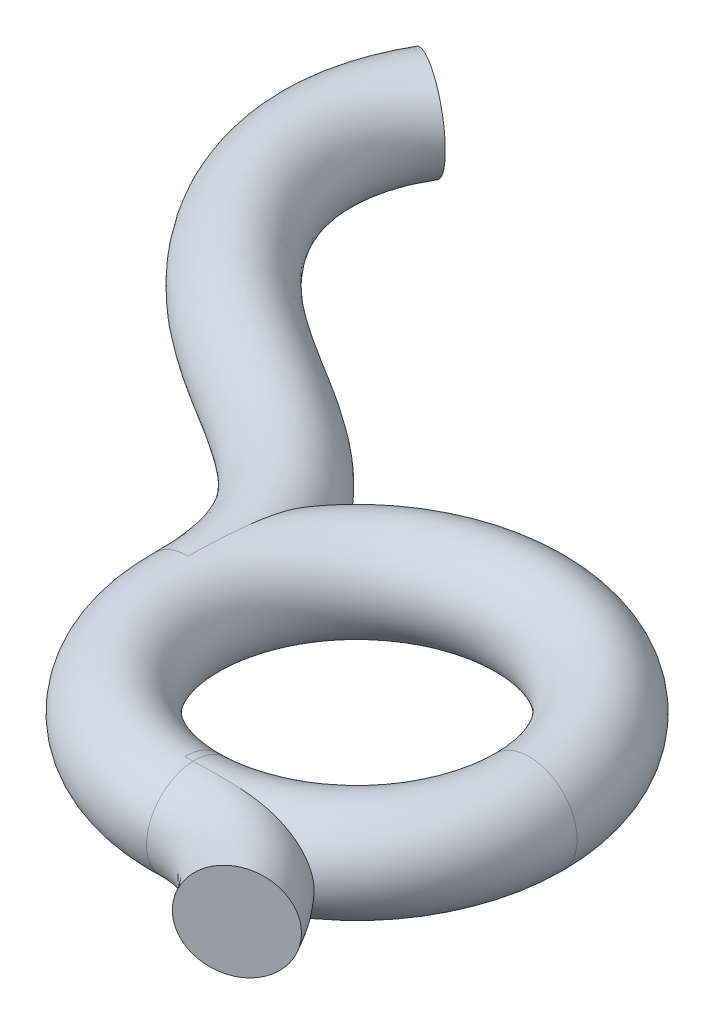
ISO-10303-21;
HEADER;
FILE_DESCRIPTION(('STEP AP214'),'2;1');
FILE_NAME('part.step','',(''),(''),'','','');
FILE_SCHEMA(('AUTOMOTIVE_DESIGN { 1 0 10303 214 1 1 1 1 }'));
ENDSEC;
DATA;
#1=APPLICATION_CONTEXT('core data for automotive mechanical design processes');
#2=APPLICATION_PROTOCOL_DEFINITION('international standard','automotive_design',2000,#1);
#3=PRODUCT_CONTEXT('',#1,'mechanical');
#4=PRODUCT('Part','Part','',(#3));
#5=PRODUCT_RELATED_PRODUCT_CATEGORY('part','',(#4));
#6=PRODUCT_DEFINITION_FORMATION('','',#4);
#7=PRODUCT_DEFINITION_CONTEXT('part definition',#1,'design');
#8=PRODUCT_DEFINITION('design','',#6,#7);
#9=PRODUCT_DEFINITION_SHAPE('','',#8);
#10=(LENGTH_UNIT() NAMED_UNIT(*) SI_UNIT(.MILLI.,.METRE.));
#11=(NAMED_UNIT(*) PLANE_ANGLE_UNIT() SI_UNIT($,.RADIAN.));
#12=(NAMED_UNIT(*) SI_UNIT($,.STERADIAN.) SOLID_ANGLE_UNIT());
#13=UNCERTAINTY_MEASURE_WITH_UNIT(LENGTH_MEASURE(1.E-05),#10,'distance_accuracy_value','');
#14=(GEOMETRIC_REPRESENTATION_CONTEXT(3) GLOBAL_UNCERTAINTY_ASSIGNED_CONTEXT((#13)) GLOBAL_UNIT_ASSIGNED_CONTEXT((#10,
#11,#12)) REPRESENTATION_CONTEXT('',''));
#15=CARTESIAN_POINT('',(0.,0.,0.));
#16=DIRECTION('',(0.,0.,1.));
#17=DIRECTION('',(1.,0.,0.));
#18=AXIS2_PLACEMENT_3D('',#15,#16,#17);
#19=CARTESIAN_POINT('',(0.,0.,0.));
#20=DIRECTION('',(0.,1.,0.));
#21=DIRECTION('',(0.,0.,1.));
#22=AXIS2_PLACEMENT_3D('',#19,#20,#21);
#23=TOROIDAL_SURFACE('',#22,4.57199999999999,1.27);
#24=CARTESIAN_POINT('',(-4.57125664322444,1.27,-0.0824421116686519));
#25=CARTESIAN_POINT('',(-4.57102640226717,1.26999974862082,-0.102875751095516));
#26=CARTESIAN_POINT('',(-4.57076214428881,1.26999984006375,-0.123309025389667));
#27=CARTESIAN_POINT('',(-4.56934847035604,1.26999961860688,-0.220367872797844));
#28=CARTESIAN_POINT('',(-4.56776340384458,1.26999750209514,-0.296987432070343));
#29=CARTESIAN_POINT('',(-4.56323711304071,1.26993153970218,-0.468747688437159));
#30=CARTESIAN_POINT('',(-4.56006048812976,1.26985287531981,-0.563882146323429));
#31=CARTESIAN_POINT('',(-4.55336028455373,1.26941110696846,-0.732918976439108));
#32=CARTESIAN_POINT('',(-4.55007155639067,1.26911525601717,-0.806831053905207));
#33=CARTESIAN_POINT('',(-4.53924451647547,1.26765845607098,-1.02849538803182));
#34=CARTESIAN_POINT('',(-4.53074464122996,1.26592834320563,-1.17619825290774));
#35=CARTESIAN_POINT('',(-4.51178468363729,1.25878900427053,-1.4715849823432));
#36=CARTESIAN_POINT('',(-4.50132239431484,1.25337561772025,-1.6192686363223));
#37=CARTESIAN_POINT('',(-4.48326316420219,1.23898936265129,-1.85813739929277));
#38=CARTESIAN_POINT('',(-4.47608723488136,1.23214941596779,-1.94947641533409));
#39=CARTESIAN_POINT('',(-4.46133628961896,1.21480273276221,-2.13180974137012));
#40=CARTESIAN_POINT('',(-4.45376118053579,1.20429513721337,-2.22280396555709));
#41=CARTESIAN_POINT('',(-4.43835601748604,1.1784670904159,-2.40394155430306));
#42=CARTESIAN_POINT('',(-4.43052644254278,1.16315526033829,-2.49408614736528));
#43=CARTESIAN_POINT('',(-4.41474172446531,1.12632993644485,-2.67306396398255));
#44=CARTESIAN_POINT('',(-4.40678666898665,1.10482060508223,-2.76189802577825));
#45=CARTESIAN_POINT('',(-4.39060428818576,1.05296860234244,-2.94071382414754));
#46=CARTESIAN_POINT('',(-4.38237821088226,1.02231902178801,-3.03060909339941));
#47=CARTESIAN_POINT('',(-4.36620890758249,0.950327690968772,-3.20618002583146));
#48=CARTESIAN_POINT('',(-4.35826558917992,0.908989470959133,-3.29185707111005));
#49=CARTESIAN_POINT('',(-4.34465621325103,0.823596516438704,-3.43794592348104));
#50=CARTESIAN_POINT('',(-4.33886983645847,0.782074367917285,-3.49980784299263));
#51=CARTESIAN_POINT('',(-4.32792814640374,0.689890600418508,-3.61640692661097));
#52=CARTESIAN_POINT('',(-4.32277157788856,0.639247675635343,-3.67115827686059));
#53=CARTESIAN_POINT('',(-4.31480272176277,0.544484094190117,-3.75554770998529));
#54=CARTESIAN_POINT('',(-4.31174540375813,0.502771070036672,-3.78785229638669));
#55=CARTESIAN_POINT('',(-4.30628357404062,0.414679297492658,-3.8454748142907));
#56=CARTESIAN_POINT('',(-4.30387873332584,0.368302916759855,-3.87079626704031));
#57=CARTESIAN_POINT('',(-4.29987447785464,0.271166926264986,-3.91291435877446));
#58=CARTESIAN_POINT('',(-4.29828346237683,0.220367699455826,-3.92962211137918));
#59=CARTESIAN_POINT('',(-4.29609800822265,0.116436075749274,-3.95256305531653));
#60=CARTESIAN_POINT('',(-4.29550243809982,0.0633063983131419,-3.95880813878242));
#61=CARTESIAN_POINT('',(-4.2953783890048,-0.0351307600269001,-3.96010902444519));
#62=CARTESIAN_POINT('',(-4.2957041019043,-0.0804239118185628,-3.95669373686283));
#63=CARTESIAN_POINT('',(-4.29709265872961,-0.16972503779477,-3.94212315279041));
#64=CARTESIAN_POINT('',(-4.2981555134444,-0.213732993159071,-3.93096774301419));
#65=CARTESIAN_POINT('',(-4.30090590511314,-0.29824962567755,-3.90206731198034));
#66=CARTESIAN_POINT('',(-4.3025772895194,-0.338818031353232,-3.88449264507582));
#67=CARTESIAN_POINT('',(-4.3064522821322,-0.417030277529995,-3.84368881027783));
#68=CARTESIAN_POINT('',(-4.30865691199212,-0.454668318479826,-3.82044878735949));
#69=CARTESIAN_POINT('',(-4.31472107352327,-0.544808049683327,-3.75641610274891));
#70=CARTESIAN_POINT('',(-4.31885383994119,-0.595206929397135,-3.71268878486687));
#71=CARTESIAN_POINT('',(-4.32779584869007,-0.688376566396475,-3.61779186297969));
#72=CARTESIAN_POINT('',(-4.33260669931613,-0.73112862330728,-3.5666045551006));
#73=CARTESIAN_POINT('',(-4.34155183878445,-0.80078855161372,-3.47111443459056));
#74=CARTESIAN_POINT('',(-4.34559889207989,-0.829106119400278,-3.42780960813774));
#75=CARTESIAN_POINT('',(-4.35387883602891,-0.881790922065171,-3.33896025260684));
#76=CARTESIAN_POINT('',(-4.35811150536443,-0.906162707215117,-3.29341838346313));
#77=CARTESIAN_POINT('',(-4.36671626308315,-0.951437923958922,-3.20055093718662));
#78=CARTESIAN_POINT('',(-4.37108863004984,-0.972333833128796,-3.15322175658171));
#79=CARTESIAN_POINT('',(-4.37991646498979,-1.01098807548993,-3.05730595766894));
#80=CARTESIAN_POINT('',(-4.38437195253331,-1.02874565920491,-3.00871904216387));
#81=CARTESIAN_POINT('',(-4.39496664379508,-1.06750624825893,-2.89259894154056));
#82=CARTESIAN_POINT('',(-4.40112278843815,-1.08730315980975,-2.82466584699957));
#83=CARTESIAN_POINT('',(-4.4134209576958,-1.12255421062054,-2.68766899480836));
#84=CARTESIAN_POINT('',(-4.41956297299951,-1.13800602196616,-2.61860465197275));
#85=CARTESIAN_POINT('',(-4.43787701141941,-1.17901370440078,-2.41011990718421));
#86=CARTESIAN_POINT('',(-4.44991650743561,-1.19915363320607,-2.26963017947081));
#87=CARTESIAN_POINT('',(-4.4731897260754,-1.22992684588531,-1.9870371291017));
#88=CARTESIAN_POINT('',(-4.48441950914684,-1.2405162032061,-1.84492936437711));
#89=CARTESIAN_POINT('',(-4.50552054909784,-1.25575136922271,-1.56045339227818));
#90=CARTESIAN_POINT('',(-4.51539302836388,-1.26040255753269,-1.41808553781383));
#91=CARTESIAN_POINT('',(-4.53021560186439,-1.26547501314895,-1.18174303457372));
#92=CARTESIAN_POINT('',(-4.53569647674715,-1.26679770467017,-1.08781481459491));
#93=CARTESIAN_POINT('',(-4.54567431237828,-1.26862620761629,-0.900085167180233));
#94=CARTESIAN_POINT('',(-4.5501732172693,-1.26913364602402,-0.806283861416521));
#95=CARTESIAN_POINT('',(-4.55624491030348,-1.26961576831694,-0.661547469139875));
#96=CARTESIAN_POINT('',(-4.55821489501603,-1.26972796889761,-0.61062897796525));
#97=CARTESIAN_POINT('',(-4.56180020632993,-1.26988297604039,-0.508759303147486));
#98=CARTESIAN_POINT('',(-4.56341539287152,-1.2699257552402,-0.457808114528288));
#99=CARTESIAN_POINT('',(-4.56729455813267,-1.26999965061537,-0.319161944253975));
#100=CARTESIAN_POINT('',(-4.56918691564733,-1.27000012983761,-0.231455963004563));
#101=CARTESIAN_POINT('',(-4.57076215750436,-1.26999971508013,-0.12330900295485));
#102=CARTESIAN_POINT('',(-4.5710264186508,-1.26999959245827,-0.102875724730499));
#103=CARTESIAN_POINT('',(-4.57125664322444,-1.27,-0.0824421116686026));
#104=B_SPLINE_CURVE_WITH_KNOTS('',3,(#24,#25,#26,#27,#28,#29,#30,#31,#32,#33,#34,#35,#36,#37,
#38,#39,#40,#41,#42,#43,#44,#45,#46,#47,#48,#49,#50,#51,#52,#53,#54,#55,#56,#57,#58,#59,#60,#61,
#62,#63,#64,#65,#66,#67,#68,#69,#70,#71,#72,#73,#74,#75,#76,#77,#78,#79,#80,#81,#82,#83,#84,#85,
#86,#87,#88,#89,#90,#91,#92,#93,#94,#95,#96,#97,#98,#99,#100,#101,#102,#103),.UNSPECIFIED.,.F.,
.F.,(4,2,2,2,2,2,2,2,2,2,2,2,2,2,2,2,2,2,2,2,2,2,2,2,2,2,2,2,2,2,2,2,2,2,2,2,2,2,2,4),(0.,
0.0613048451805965,0.291206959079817,0.576760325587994,0.798714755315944,1.2425560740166,
1.68689957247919,1.96247213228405,2.23810927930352,2.51325459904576,2.78821555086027,
3.07371302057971,3.35911631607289,3.58263509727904,3.80570085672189,3.96368837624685,
4.12159608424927,4.2811022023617,4.44042689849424,4.57600616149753,4.71158740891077,
4.84380489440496,4.97627773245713,5.17570831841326,5.37562013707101,5.53110577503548,
5.68641080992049,5.84204769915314,5.99772170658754,6.2106140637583,6.42362026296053,
6.85032930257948,7.27899106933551,7.70726421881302,7.98955045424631,8.27127263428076,
8.4241417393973,8.5770710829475,8.84024065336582,8.90154549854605),.UNSPECIFIED.);
#105=CARTESIAN_POINT('',(-4.57125664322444,-1.27,-0.0824421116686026));
#106=VERTEX_POINT('',#105);
#107=CARTESIAN_POINT('',(-4.57125664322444,1.27,-0.0824421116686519));
#108=VERTEX_POINT('',#107);
#109=EDGE_CURVE('E101',#106,#108,#104,.F.);
#110=ORIENTED_EDGE('',*,*,#109,.T.);
#111=CARTESIAN_POINT('',(-4.57125664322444,1.27,-0.0824421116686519));
#112=CARTESIAN_POINT('',(-4.59168589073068,1.27000405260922,-0.0826877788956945));
#113=CARTESIAN_POINT('',(-4.61212888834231,1.26950937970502,-0.0829331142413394));
#114=CARTESIAN_POINT('',(-4.70376083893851,1.26506943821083,-0.0840306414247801));
#115=CARTESIAN_POINT('',(-4.77478371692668,1.25560357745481,-0.0848755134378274));
#116=CARTESIAN_POINT('',(-4.8793203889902,1.23258760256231,-0.0861113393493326));
#117=CARTESIAN_POINT('',(-4.91387783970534,1.22342791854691,-0.0865185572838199));
#118=CARTESIAN_POINT('',(-4.9821326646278,1.20222283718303,-0.0873204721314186));
#119=CARTESIAN_POINT('',(-5.01582929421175,1.19017502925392,-0.0877151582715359));
#120=CARTESIAN_POINT('',(-5.11509273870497,1.14986909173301,-0.0888745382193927));
#121=CARTESIAN_POINT('',(-5.17900455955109,1.11741049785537,-0.0896165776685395));
#122=CARTESIAN_POINT('',(-5.30046557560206,1.04220965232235,-0.0910200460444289));
#123=CARTESIAN_POINT('',(-5.35801457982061,0.999467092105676,-0.0916814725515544));
#124=CARTESIAN_POINT('',(-5.43831788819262,0.928604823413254,-0.0926007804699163));
#125=CARTESIAN_POINT('',(-5.46409704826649,0.903841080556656,-0.0928952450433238));
#126=CARTESIAN_POINT('',(-5.51345579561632,0.852257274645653,-0.0934580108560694));
#127=CARTESIAN_POINT('',(-5.53703747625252,0.825439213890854,-0.0937263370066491));
#128=CARTESIAN_POINT('',(-5.60427923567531,0.7421184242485,-0.0944902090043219));
#129=CARTESIAN_POINT('',(-5.64445293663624,0.682734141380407,-0.0949448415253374));
#130=CARTESIAN_POINT('',(-5.71423609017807,0.558096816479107,-0.0957328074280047));
#131=CARTESIAN_POINT('',(-5.74384613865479,0.4928441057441,-0.0960661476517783));
#132=CARTESIAN_POINT('',(-5.79169709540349,0.358286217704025,-0.0966041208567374));
#133=CARTESIAN_POINT('',(-5.80993815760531,0.288981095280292,-0.0968087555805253));
#134=CARTESIAN_POINT('',(-5.83452486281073,0.148294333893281,-0.097084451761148));
#135=CARTESIAN_POINT('',(-5.84087057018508,0.076912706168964,-0.0971555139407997));
#136=CARTESIAN_POINT('',(-5.84148959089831,-0.0659028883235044,-0.0971624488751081));
#137=CARTESIAN_POINT('',(-5.83576290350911,-0.137336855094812,-0.0970983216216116));
#138=CARTESIAN_POINT('',(-5.81239689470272,-0.27823022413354,-0.0968363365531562));
#139=CARTESIAN_POINT('',(-5.79475772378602,-0.347689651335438,-0.0966384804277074));
#140=CARTESIAN_POINT('',(-5.74807619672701,-0.482655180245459,-0.0961137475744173));
#141=CARTESIAN_POINT('',(-5.71903366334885,-0.548161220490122,-0.095786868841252));
#142=CARTESIAN_POINT('',(-5.6503355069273,-0.673397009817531,-0.095011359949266));
#143=CARTESIAN_POINT('',(-5.61067932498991,-0.73312645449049,-0.0945627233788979));
#144=CARTESIAN_POINT('',(-5.54416473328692,-0.817025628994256,-0.0938073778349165));
#145=CARTESIAN_POINT('',(-5.52081747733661,-0.844046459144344,-0.0935418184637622));
#146=CARTESIAN_POINT('',(-5.4719101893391,-0.896054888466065,-0.0929844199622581));
#147=CARTESIAN_POINT('',(-5.44634806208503,-0.921040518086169,-0.0926925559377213));
#148=CARTESIAN_POINT('',(-5.36666568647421,-0.992595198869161,-0.0917807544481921));
#149=CARTESIAN_POINT('',(-5.30949156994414,-1.03583489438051,-0.0911239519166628));
#150=CARTESIAN_POINT('',(-5.18869040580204,-1.11208736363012,-0.0897288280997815));
#151=CARTESIAN_POINT('',(-5.12506331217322,-1.14510006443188,-0.088990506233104));
#152=CARTESIAN_POINT('',(-5.02530073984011,-1.18662179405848,-0.087825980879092));
#153=CARTESIAN_POINT('',(-4.99082854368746,-1.19924307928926,-0.0874224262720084));
#154=CARTESIAN_POINT('',(-4.9209575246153,-1.22145031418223,-0.0866019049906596));
#155=CARTESIAN_POINT('',(-4.8855594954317,-1.23103877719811,-0.0861849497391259));
#156=CARTESIAN_POINT('',(-4.77843561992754,-1.25511083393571,-0.0849189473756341));
#157=CARTESIAN_POINT('',(-4.70558917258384,-1.26498031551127,-0.0840525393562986));
#158=CARTESIAN_POINT('',(-4.61212850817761,-1.2695095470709,-0.0829331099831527));
#159=CARTESIAN_POINT('',(-4.59168549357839,-1.2700042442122,-0.0826877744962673));
#160=CARTESIAN_POINT('',(-4.57125664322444,-1.27,-0.0824421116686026));
#161=B_SPLINE_CURVE_WITH_KNOTS('',3,(#111,#112,#113,#114,#115,#116,#117,#118,#119,#120,#121,
#122,#123,#124,#125,#126,#127,#128,#129,#130,#131,#132,#133,#134,#135,#136,#137,#138,#139,#140,
#141,#142,#143,#144,#145,#146,#147,#148,#149,#150,#151,#152,#153,#154,#155,#156,#157,#158,#159,
#160),.UNSPECIFIED.,.F.,.F.,(4,2,2,2,2,2,2,2,2,2,2,2,2,2,2,2,2,2,2,2,2,2,2,2,4),(0.,
0.0613226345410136,0.275067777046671,0.382227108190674,0.489476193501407,0.703454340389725,
0.917438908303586,1.02457019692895,1.13159836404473,1.3455878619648,1.55956528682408,
1.7735398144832,1.98751318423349,2.20148656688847,2.41545724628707,2.62943125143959,
2.84341652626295,2.95044108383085,3.05756801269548,3.27154632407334,3.48552616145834,
3.59553832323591,3.70545907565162,3.92468856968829,3.98601120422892),.UNSPECIFIED.);
#162=EDGE_CURVE('E108',#108,#106,#161,.T.);
#163=ORIENTED_EDGE('',*,*,#162,.T.);
#164=EDGE_LOOP('',(#110,#163));
#165=FACE_BOUND('',#164,.T.);
#166=CARTESIAN_POINT('',(4.57199999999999,0.,0.));
#167=DIRECTION('',(0.,0.,1.));
#168=DIRECTION('',(1.,0.,0.));
#169=AXIS2_PLACEMENT_3D('',#166,#167,#168);
#170=CIRCLE('',#169,1.27);
#171=CARTESIAN_POINT('',(5.84199999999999,0.,0.));
#172=VERTEX_POINT('',#171);
#173=EDGE_CURVE('E96',#172,#172,#170,.T.);
#174=ORIENTED_EDGE('',*,*,#173,.F.);
#175=EDGE_LOOP('',(#174));
#176=FACE_BOUND('',#175,.T.);
#177=CARTESIAN_POINT('',(1.43161061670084E-13,-1.27,4.57199999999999));
#178=CARTESIAN_POINT('',(-0.000254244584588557,-1.2700010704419,4.56090445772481));
#179=CARTESIAN_POINT('',(-0.000507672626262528,-1.26985539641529,4.54980452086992));
#180=CARTESIAN_POINT('',(-0.00238108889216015,-1.26768966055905,4.46745493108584));
#181=CARTESIAN_POINT('',(-0.00396417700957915,-1.25979004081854,4.39622000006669));
#182=CARTESIAN_POINT('',(-0.00624419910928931,-1.23908258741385,4.29117385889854));
#183=CARTESIAN_POINT('',(-0.00698948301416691,-1.23068451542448,4.25640881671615));
#184=CARTESIAN_POINT('',(-0.00844535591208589,-1.21098233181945,4.1876749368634));
#185=CARTESIAN_POINT('',(-0.00915591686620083,-1.19967591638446,4.15370675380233));
#186=CARTESIAN_POINT('',(-0.0112256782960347,-1.161555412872,4.05354579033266));
#187=CARTESIAN_POINT('',(-0.0125268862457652,-1.13050405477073,3.98891499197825));
#188=CARTESIAN_POINT('',(-0.0149484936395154,-1.05797392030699,3.86578750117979));
#189=CARTESIAN_POINT('',(-0.0160688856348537,-1.01649471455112,3.80729106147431));
#190=CARTESIAN_POINT('',(-0.0176031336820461,-0.947394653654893,3.7254220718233));
#191=CARTESIAN_POINT('',(-0.018090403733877,-0.923198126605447,3.69909790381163));
#192=CARTESIAN_POINT('',(-0.0190150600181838,-0.872699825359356,3.64860392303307));
#193=CARTESIAN_POINT('',(-0.019452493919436,-0.84640010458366,3.62443205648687));
#194=CARTESIAN_POINT('',(-0.020689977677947,-0.76455518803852,3.55535609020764));
#195=CARTESIAN_POINT('',(-0.0214155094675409,-0.706050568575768,3.51387545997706));
#196=CARTESIAN_POINT('',(-0.0226645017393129,-0.58295217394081,3.44136156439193));
#197=CARTESIAN_POINT('',(-0.0231880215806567,-0.518360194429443,3.41032523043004));
#198=CARTESIAN_POINT('',(-0.0240360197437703,-0.384874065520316,3.35953283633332));
#199=CARTESIAN_POINT('',(-0.0243605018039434,-0.315979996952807,3.33977656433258));
#200=CARTESIAN_POINT('',(-0.0248128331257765,-0.175870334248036,3.31211807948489));
#201=CARTESIAN_POINT('',(-0.0249407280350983,-0.104655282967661,3.30421311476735));
#202=CARTESIAN_POINT('',(-0.0250014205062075,0.0380912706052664,3.30047041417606));
#203=CARTESIAN_POINT('',(-0.0249342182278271,0.10962277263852,3.30463266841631));
#204=CARTESIAN_POINT('',(-0.0246039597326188,0.250964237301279,3.32490760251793));
#205=CARTESIAN_POINT('',(-0.0243409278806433,0.320774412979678,3.34101879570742));
#206=CARTESIAN_POINT('',(-0.0236168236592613,0.456693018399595,3.38472329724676));
#207=CARTESIAN_POINT('',(-0.0231557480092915,0.522801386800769,3.4123167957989));
#208=CARTESIAN_POINT('',(-0.0220324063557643,0.649482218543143,3.47823719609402));
#209=CARTESIAN_POINT('',(-0.0213701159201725,0.710054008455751,3.51656540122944));
#210=CARTESIAN_POINT('',(-0.0202270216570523,0.795374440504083,3.58120708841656));
#211=CARTESIAN_POINT('',(-0.0198209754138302,0.822895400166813,3.6039498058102));
#212=CARTESIAN_POINT('',(-0.0189587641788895,0.875954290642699,3.65169082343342));
#213=CARTESIAN_POINT('',(-0.0185025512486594,0.901490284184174,3.67669127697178));
#214=CARTESIAN_POINT('',(-0.0170604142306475,0.974774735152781,3.75477126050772));
#215=CARTESIAN_POINT('',(-0.0160001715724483,1.01926156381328,3.81097640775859));
#216=CARTESIAN_POINT('',(-0.0136937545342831,1.0981536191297,3.93005789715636));
#217=CARTESIAN_POINT('',(-0.0124475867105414,1.13255920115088,3.9929340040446));
#218=CARTESIAN_POINT('',(-0.0104540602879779,1.17590511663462,4.09091464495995));
#219=CARTESIAN_POINT('',(-0.0097677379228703,1.18898980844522,4.12423764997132));
#220=CARTESIAN_POINT('',(-0.00835786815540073,1.21229462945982,4.19183375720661));
#221=CARTESIAN_POINT('',(-0.00763435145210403,1.22251707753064,4.22610606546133));
#222=CARTESIAN_POINT('',(-0.00541519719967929,1.24874603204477,4.32991456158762));
#223=CARTESIAN_POINT('',(-0.00386709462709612,1.26039819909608,4.40063275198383));
#224=CARTESIAN_POINT('',(-0.00177348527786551,1.2678018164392,4.49400560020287));
#225=CARTESIAN_POINT('',(-0.00126884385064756,1.26897768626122,4.51634711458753));
#226=CARTESIAN_POINT('',(-0.000507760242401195,1.26985418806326,4.54980001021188));
#227=CARTESIAN_POINT('',(-0.000254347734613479,1.26999957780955,4.56089908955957));
#228=CARTESIAN_POINT('',(1.50786352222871E-13,1.27,4.57199999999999));
#229=B_SPLINE_CURVE_WITH_KNOTS('',3,(#177,#178,#179,#180,#181,#182,#183,#184,#185,#186,#187,
#188,#189,#190,#191,#192,#193,#194,#195,#196,#197,#198,#199,#200,#201,#202,#203,#204,#205,#206,
#207,#208,#209,#210,#211,#212,#213,#214,#215,#216,#217,#218,#219,#220,#221,#222,#223,#224,#225,
#226,#227,#228),.UNSPECIFIED.,.F.,.F.,(4,2,2,2,2,2,2,2,2,2,2,2,2,2,2,2,2,2,2,2,2,2,2,2,2,4),(0.,
0.0333065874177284,0.24710719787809,0.354329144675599,0.461636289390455,0.675702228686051,
0.889776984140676,0.996940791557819,1.10400121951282,1.31805936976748,1.53205457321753,
1.74604575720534,1.95998724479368,2.17392855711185,2.3878432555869,2.60176149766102,
2.81570572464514,2.92270975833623,3.02981694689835,3.2438011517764,3.45777781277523,
3.56508218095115,3.67229936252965,3.88611657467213,3.95323321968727,3.98653980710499),.UNSPECIFIED.);
#230=CARTESIAN_POINT('',(0.,1.27,4.572));
#231=VERTEX_POINT('',#230);
#232=CARTESIAN_POINT('',(0.,-1.27,4.572));
#233=VERTEX_POINT('',#232);
#234=EDGE_CURVE('E60',#231,#233,#229,.F.);
#235=ORIENTED_EDGE('',*,*,#234,.T.);
#236=CARTESIAN_POINT('',(1.43161061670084E-13,-1.27,4.57199999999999));
#237=CARTESIAN_POINT('',(0.0110983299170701,-1.26999993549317,4.57174571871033));
#238=CARTESIAN_POINT('',(0.0221966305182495,-1.26999988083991,4.57149017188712));
#239=CARTESIAN_POINT('',(0.0822026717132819,-1.26999963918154,4.5701030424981));
#240=CARTESIAN_POINT('',(0.131109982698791,-1.26999963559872,4.56895292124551));
#241=CARTESIAN_POINT('',(0.191061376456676,-1.26999987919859,4.56754630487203));
#242=CARTESIAN_POINT('',(0.202105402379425,-1.26999993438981,4.56728731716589));
#243=CARTESIAN_POINT('',(0.213149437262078,-1.27,4.56702871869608));
#244=B_SPLINE_CURVE_WITH_KNOTS('',3,(#236,#237,#238,#239,#240,#241,#242,#243),.UNSPECIFIED.,.F.,
.F.,(4,2,2,4),(0.,0.033303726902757,0.180066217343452,0.213207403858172),.UNSPECIFIED.);
#245=CARTESIAN_POINT('',(0.213149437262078,-1.27,4.56702871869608));
#246=VERTEX_POINT('',#245);
#247=EDGE_CURVE('E12',#233,#246,#244,.T.);
#248=ORIENTED_EDGE('',*,*,#247,.T.);
#249=CARTESIAN_POINT('',(0.213149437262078,-1.27,4.56702871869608));
#250=CARTESIAN_POINT('',(0.213453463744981,-1.27000105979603,4.57806882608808));
#251=CARTESIAN_POINT('',(0.213756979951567,-1.26985678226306,4.58911328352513));
#252=CARTESIAN_POINT('',(0.216013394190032,-1.26770295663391,4.67138887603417));
#253=CARTESIAN_POINT('',(0.21794069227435,-1.25981316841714,4.74260607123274));
#254=CARTESIAN_POINT('',(0.220746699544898,-1.2391213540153,4.8476268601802));
#255=CARTESIAN_POINT('',(0.221669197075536,-1.2307286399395,4.88238368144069));
#256=CARTESIAN_POINT('',(0.223481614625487,-1.21103744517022,4.95110158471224));
#257=CARTESIAN_POINT('',(0.22437150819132,-1.19973666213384,4.98506201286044));
#258=CARTESIAN_POINT('',(0.226979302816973,-1.16163346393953,5.08520041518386));
#259=CARTESIAN_POINT('',(0.228640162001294,-1.13059418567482,5.14981720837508));
#260=CARTESIAN_POINT('',(0.231769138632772,-1.05808920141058,5.27291949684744));
#261=CARTESIAN_POINT('',(0.233237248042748,-1.01662306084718,5.33140473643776));
#262=CARTESIAN_POINT('',(0.235272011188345,-0.947542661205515,5.41326035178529));
#263=CARTESIAN_POINT('',(0.235922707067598,-0.923352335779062,5.43958094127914));
#264=CARTESIAN_POINT('',(0.237165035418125,-0.872866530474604,5.49006866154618));
#265=CARTESIAN_POINT('',(0.237756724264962,-0.846573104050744,5.51423784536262));
#266=CARTESIAN_POINT('',(0.239440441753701,-0.764747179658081,5.58330728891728));
#267=CARTESIAN_POINT('',(0.240441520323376,-0.706255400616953,5.62478556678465));
#268=CARTESIAN_POINT('',(0.242181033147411,-0.583177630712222,5.69730262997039));
#269=CARTESIAN_POINT('',(0.242919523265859,-0.518592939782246,5.72834363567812));
#270=CARTESIAN_POINT('',(0.244123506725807,-0.385120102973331,5.77914918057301));
#271=CARTESIAN_POINT('',(0.244589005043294,-0.316232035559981,5.79891392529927));
#272=CARTESIAN_POINT('',(0.245239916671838,-0.176126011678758,5.82659476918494));
#273=CARTESIAN_POINT('',(0.245425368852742,-0.104908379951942,5.83451251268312));
#274=CARTESIAN_POINT('',(0.245513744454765,0.0378456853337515,5.83828252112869));
#275=CARTESIAN_POINT('',(0.245416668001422,0.109382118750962,5.83413479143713));
#276=CARTESIAN_POINT('',(0.244941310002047,0.25073931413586,5.81388961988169));
#277=CARTESIAN_POINT('',(0.244563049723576,0.320560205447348,5.79779308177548));
#278=CARTESIAN_POINT('',(0.24353103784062,0.456502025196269,5.75411715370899));
#279=CARTESIAN_POINT('',(0.242877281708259,0.522622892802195,5.72653757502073));
#280=CARTESIAN_POINT('',(0.2413033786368,0.649327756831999,5.66064446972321));
#281=CARTESIAN_POINT('',(0.240383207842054,0.709911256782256,5.62232998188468));
#282=CARTESIAN_POINT('',(0.238816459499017,0.795249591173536,5.55770755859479));
#283=CARTESIAN_POINT('',(0.238263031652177,0.822776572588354,5.53497104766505));
#284=CARTESIAN_POINT('',(0.237095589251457,0.875847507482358,5.48724193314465));
#285=CARTESIAN_POINT('',(0.236481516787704,0.901389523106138,5.46224717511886));
#286=CARTESIAN_POINT('',(0.234553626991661,0.974687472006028,5.38418802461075));
#287=CARTESIAN_POINT('',(0.233152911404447,1.01918232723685,5.32799790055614));
#288=CARTESIAN_POINT('',(0.230148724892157,1.09809051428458,5.20894505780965));
#289=CARTESIAN_POINT('',(0.22854526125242,1.13250420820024,5.14608257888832));
#290=CARTESIAN_POINT('',(0.2260141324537,1.17585980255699,5.04812565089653));
#291=CARTESIAN_POINT('',(0.22514813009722,1.18894670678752,5.01481348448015));
#292=CARTESIAN_POINT('',(0.22338008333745,1.21225648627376,4.94723887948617));
#293=CARTESIAN_POINT('',(0.222478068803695,1.22248168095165,4.9129772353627));
#294=CARTESIAN_POINT('',(0.21972779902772,1.24871963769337,4.80920025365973));
#295=CARTESIAN_POINT('',(0.217830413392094,1.26037877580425,4.73850263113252));
#296=CARTESIAN_POINT('',(0.215288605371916,1.26780090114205,4.64505209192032));
#297=CARTESIAN_POINT('',(0.214675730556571,1.26898201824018,4.62261294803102));
#298=CARTESIAN_POINT('',(0.213757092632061,1.26985558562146,4.58911774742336));
#299=CARTESIAN_POINT('',(0.213453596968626,1.26999958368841,4.57807413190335));
#300=CARTESIAN_POINT('',(0.213149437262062,1.27,4.56702871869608));
#301=B_SPLINE_CURVE_WITH_KNOTS('',3,(#249,#250,#251,#252,#253,#254,#255,#256,#257,#258,#259,
#260,#261,#262,#263,#264,#265,#266,#267,#268,#269,#270,#271,#272,#273,#274,#275,#276,#277,#278,
#279,#280,#281,#282,#283,#284,#285,#286,#287,#288,#289,#290,#291,#292,#293,#294,#295,#296,#297,
#298,#299,#300),.UNSPECIFIED.,.F.,.F.,(4,2,2,2,2,2,2,2,2,2,2,2,2,2,2,2,2,2,2,2,2,2,2,2,2,4),(0.,
0.0331440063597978,0.246913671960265,0.354120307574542,0.461412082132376,0.675446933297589,
0.889490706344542,0.996641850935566,1.103689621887,1.31772260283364,1.53171002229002,
1.74569354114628,1.95964735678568,2.17360107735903,2.38753861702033,2.6014796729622,
2.81543989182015,2.92245189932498,3.02956709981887,3.24354832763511,3.45752186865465,
3.56481012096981,3.67201116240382,3.88579661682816,3.95321423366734,3.98635824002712),.UNSPECIFIED.);
#302=CARTESIAN_POINT('',(0.213149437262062,1.27,4.56702871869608));
#303=VERTEX_POINT('',#302);
#304=EDGE_CURVE('E146',#246,#303,#301,.T.);
#305=ORIENTED_EDGE('',*,*,#304,.T.);
#306=CARTESIAN_POINT('',(1.50786352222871E-13,1.27,4.57199999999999));
#307=CARTESIAN_POINT('',(0.0110983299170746,1.26999993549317,4.57174571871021));
#308=CARTESIAN_POINT('',(0.0221966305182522,1.26999988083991,4.57149017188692));
#309=CARTESIAN_POINT('',(0.0822026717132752,1.26999963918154,4.57010304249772));
#310=CARTESIAN_POINT('',(0.131109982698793,1.26999963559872,4.56895292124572));
#311=CARTESIAN_POINT('',(0.191061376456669,1.26999987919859,4.56754630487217));
#312=CARTESIAN_POINT('',(0.202105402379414,1.26999993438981,4.56728731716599));
#313=CARTESIAN_POINT('',(0.213149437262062,1.27,4.56702871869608));
#314=B_SPLINE_CURVE_WITH_KNOTS('',3,(#306,#307,#308,#309,#310,#311,#312,#313),.UNSPECIFIED.,.F.,
.F.,(4,2,2,4),(0.,0.0333037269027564,0.180066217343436,0.213207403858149),.UNSPECIFIED.);
#315=EDGE_CURVE('E145',#303,#231,#314,.F.);
#316=ORIENTED_EDGE('',*,*,#315,.T.);
#317=EDGE_LOOP('',(#235,#248,#305,#316));
#318=FACE_BOUND('',#317,.T.);
#319=ADVANCED_FACE('F47',(#165,#176,#318),#23,.T.);
#320=CARTESIAN_POINT('',(0.213149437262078,-1.27,4.56702871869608));
#321=CARTESIAN_POINT('',(0.224193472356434,-1.26999996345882,4.56677013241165));
#322=CARTESIAN_POINT('',(0.235237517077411,-1.26999990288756,4.56651194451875));
#323=CARTESIAN_POINT('',(0.280708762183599,-1.26999901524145,4.56545166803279));
#324=CARTESIAN_POINT('',(0.315136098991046,-1.26999683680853,4.5646554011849));
#325=CARTESIAN_POINT('',(0.381240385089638,-1.26998214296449,4.56315462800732));
#326=CARTESIAN_POINT('',(0.412917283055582,-1.26997046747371,4.56244787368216));
#327=CARTESIAN_POINT('',(0.45451451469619,-1.26994236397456,4.56154449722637));
#328=CARTESIAN_POINT('',(0.464434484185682,-1.26993470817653,4.56133090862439));
#329=CARTESIAN_POINT('',(0.514034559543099,-1.26989064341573,4.56027315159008));
#330=CARTESIAN_POINT('',(0.553715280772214,-1.26983687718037,4.55945954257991));
#331=CARTESIAN_POINT('',(0.672728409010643,-1.2695791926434,4.55715475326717));
#332=CARTESIAN_POINT('',(0.752063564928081,-1.26927892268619,4.5557988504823));
#333=CARTESIAN_POINT('',(0.910809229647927,-1.26807275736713,4.55362986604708));
#334=CARTESIAN_POINT('',(0.990219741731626,-1.26716631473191,4.55281727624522));
#335=CARTESIAN_POINT('',(1.1711178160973,-1.26384371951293,4.55175853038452));
#336=CARTESIAN_POINT('',(1.27260191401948,-1.26107775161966,4.5517328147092));
#337=CARTESIAN_POINT('',(1.47546754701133,-1.25235085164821,4.55302095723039));
#338=CARTESIAN_POINT('',(1.57684904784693,-1.24638907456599,4.55433516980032));
#339=CARTESIAN_POINT('',(1.77899329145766,-1.2295233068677,4.55836532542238));
#340=CARTESIAN_POINT('',(1.87975688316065,-1.21862963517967,4.56107834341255));
#341=CARTESIAN_POINT('',(2.08020401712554,-1.1898215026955,4.5678638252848));
#342=CARTESIAN_POINT('',(2.17988827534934,-1.17191203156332,4.57193532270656));
#343=CARTESIAN_POINT('',(2.37287309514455,-1.1276277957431,4.58105272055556));
#344=CARTESIAN_POINT('',(2.46626300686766,-1.10165389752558,4.58604869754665));
#345=CARTESIAN_POINT('',(2.60348171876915,-1.05450124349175,4.59408300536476));
#346=CARTESIAN_POINT('',(2.64873858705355,-1.03742081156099,4.59685081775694));
#347=CARTESIAN_POINT('',(2.73805625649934,-1.00019484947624,4.60251607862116));
#348=CARTESIAN_POINT('',(2.78211495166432,-0.980044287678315,4.60541373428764));
#349=CARTESIAN_POINT('',(2.89827892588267,-0.921395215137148,4.61328559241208));
#350=CARTESIAN_POINT('',(2.96886809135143,-0.879799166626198,4.61831937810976));
#351=CARTESIAN_POINT('',(3.10243881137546,-0.785880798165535,4.6281809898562));
#352=CARTESIAN_POINT('',(3.16544227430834,-0.73359060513,4.63300938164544));
#353=CARTESIAN_POINT('',(3.26370591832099,-0.634272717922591,4.64071157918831));
#354=CARTESIAN_POINT('',(3.30174602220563,-0.590020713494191,4.64374933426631));
#355=CARTESIAN_POINT('',(3.37031135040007,-0.495945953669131,4.64928788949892));
#356=CARTESIAN_POINT('',(3.4008397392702,-0.446125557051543,4.6517889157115));
#357=CARTESIAN_POINT('',(3.45273779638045,-0.341236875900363,4.65607091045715));
#358=CARTESIAN_POINT('',(3.47401852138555,-0.286123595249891,4.65784487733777));
#359=CARTESIAN_POINT('',(3.5052527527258,-0.172749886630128,4.6604565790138));
#360=CARTESIAN_POINT('',(3.51521827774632,-0.11449286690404,4.6612953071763));
#361=CARTESIAN_POINT('',(3.52238669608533,-0.00557535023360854,4.66189838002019));
#362=CARTESIAN_POINT('',(3.52120790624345,0.0449828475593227,4.66179896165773));
#363=CARTESIAN_POINT('',(3.50998056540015,0.145086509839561,4.66085521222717));
#364=CARTESIAN_POINT('',(3.49993348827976,0.194632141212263,4.66001100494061));
#365=CARTESIAN_POINT('',(3.4722770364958,0.289154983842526,4.65770024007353));
#366=CARTESIAN_POINT('',(3.45501779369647,0.334237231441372,4.65626253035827));
#367=CARTESIAN_POINT('',(3.41392760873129,0.421317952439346,4.65286639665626));
#368=CARTESIAN_POINT('',(3.39008934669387,0.463312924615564,4.65090739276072));
#369=CARTESIAN_POINT('',(3.3451256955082,0.531220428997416,4.64725098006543));
#370=CARTESIAN_POINT('',(3.32542598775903,0.558102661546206,4.64565882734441));
#371=CARTESIAN_POINT('',(3.28376297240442,0.609995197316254,4.64231996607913));
#372=CARTESIAN_POINT('',(3.26180172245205,0.63500716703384,4.6405733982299));
#373=CARTESIAN_POINT('',(3.19290027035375,0.707302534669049,4.63514809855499));
#374=CARTESIAN_POINT('',(3.1429958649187,0.751767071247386,4.63128817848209));
#375=CARTESIAN_POINT('',(3.01456534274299,0.851148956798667,4.62162546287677));
#376=CARTESIAN_POINT('',(2.93305874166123,0.902148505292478,4.61571047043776));
#377=CARTESIAN_POINT('',(2.76317910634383,0.990897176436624,4.60407857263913));
#378=CARTESIAN_POINT('',(2.67479396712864,1.02862226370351,4.5983620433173));
#379=CARTESIAN_POINT('',(2.50354117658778,1.08974139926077,4.58816386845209));
#380=CARTESIAN_POINT('',(2.42105059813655,1.11421526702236,4.5836156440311));
#381=CARTESIAN_POINT('',(2.25420040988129,1.15599528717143,4.57531093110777));
#382=CARTESIAN_POINT('',(2.16983914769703,1.1732948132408,4.57155517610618));
#383=CARTESIAN_POINT('',(1.99997024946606,1.20225283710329,4.56499034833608));
#384=CARTESIAN_POINT('',(1.91446057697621,1.21389940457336,4.5621832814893));
#385=CARTESIAN_POINT('',(1.74298510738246,1.23287592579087,4.55757561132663));
#386=CARTESIAN_POINT('',(1.65701945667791,1.24020718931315,4.55577470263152));
#387=CARTESIAN_POINT('',(1.45894255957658,1.25350925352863,4.55279185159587));
#388=CARTESIAN_POINT('',(1.34675816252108,1.25840450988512,4.55195992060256));
#389=CARTESIAN_POINT('',(1.12249869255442,1.26513111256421,4.5518449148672));
#390=CARTESIAN_POINT('',(1.01042373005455,1.26696732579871,4.55255937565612));
#391=CARTESIAN_POINT('',(0.778764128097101,1.26928743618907,4.55526061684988));
#392=CARTESIAN_POINT('',(0.659179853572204,1.26967239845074,4.55732949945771));
#393=CARTESIAN_POINT('',(0.441825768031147,1.26999359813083,4.56174626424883));
#394=CARTESIAN_POINT('',(0.344053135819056,1.26999884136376,4.56397453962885));
#395=CARTESIAN_POINT('',(0.235237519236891,1.26999978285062,4.56651195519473));
#396=CARTESIAN_POINT('',(0.22419347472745,1.26999982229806,4.56677014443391));
#397=CARTESIAN_POINT('',(0.213149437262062,1.27,4.56702871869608));
#398=B_SPLINE_CURVE_WITH_KNOTS('',3,(#320,#321,#322,#323,#324,#325,#326,#327,#328,#329,#330,
#331,#332,#333,#334,#335,#336,#337,#338,#339,#340,#341,#342,#343,#344,#345,#346,#347,#348,#349,
#350,#351,#352,#353,#354,#355,#356,#357,#358,#359,#360,#361,#362,#363,#364,#365,#366,#367,#368,
#369,#370,#371,#372,#373,#374,#375,#376,#377,#378,#379,#380,#381,#382,#383,#384,#385,#386,#387,
#388,#389,#390,#391,#392,#393,#394,#395,#396,#397),.UNSPECIFIED.,.F.,.F.,(4,2,2,2,2,2,2,2,2,2,2,
2,2,2,2,2,2,2,2,2,2,2,2,2,2,2,2,2,2,2,2,2,2,2,2,2,2,2,4),(0.,0.0331411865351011,
0.13645081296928,0.231505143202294,0.261271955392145,0.380339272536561,0.618378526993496,
0.856632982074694,1.16116232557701,1.46577222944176,1.76974772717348,2.07350742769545,
2.36409186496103,2.50935087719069,2.65485056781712,2.90026275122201,3.14494823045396,
3.31961757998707,3.49421321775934,3.67045281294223,3.84650503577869,3.99743424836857,
4.14833838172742,4.29263955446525,4.43710192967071,4.53707166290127,4.63695122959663,
4.83699151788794,5.12440948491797,5.41234521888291,5.67044967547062,5.92879199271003,
6.18767718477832,6.44648375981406,6.78327289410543,7.11952568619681,7.47832570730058,
7.77172016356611,7.80486135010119),.UNSPECIFIED.);
#399=EDGE_CURVE('E167',#303,#246,#398,.F.);
#400=ORIENTED_EDGE('',*,*,#399,.T.);
#401=CARTESIAN_POINT('',(0.213149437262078,-1.27,4.56702871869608));
#402=CARTESIAN_POINT('',(0.212845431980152,-1.27000105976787,4.55598861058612));
#403=CARTESIAN_POINT('',(0.212540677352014,-1.26985678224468,4.54494418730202));
#404=CARTESIAN_POINT('',(0.210265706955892,-1.2677029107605,4.46266722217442));
#405=CARTESIAN_POINT('',(0.208270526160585,-1.25981277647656,4.39145001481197));
#406=CARTESIAN_POINT('',(0.205290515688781,-1.23912017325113,4.28643127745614));
#407=CARTESIAN_POINT('',(0.204297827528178,-1.23072714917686,4.25167548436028));
#408=CARTESIAN_POINT('',(0.202322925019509,-1.2110352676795,4.18296027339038));
#409=CARTESIAN_POINT('',(0.201340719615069,-1.19973410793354,4.14900150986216));
#410=CARTESIAN_POINT('',(0.198426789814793,-1.16162973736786,4.04886901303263));
#411=CARTESIAN_POINT('',(0.19652258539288,-1.13058960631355,3.9842573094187));
#412=CARTESIAN_POINT('',(0.1928547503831,-1.05808282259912,3.86116669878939));
#413=CARTESIAN_POINT('',(0.191091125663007,-1.01661573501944,3.80268804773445));
#414=CARTESIAN_POINT('',(0.188598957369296,-0.947533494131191,3.72084240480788));
#415=CARTESIAN_POINT('',(0.187793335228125,-0.923342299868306,3.69452500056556));
#416=CARTESIAN_POINT('',(0.186240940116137,-0.87285465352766,3.6440437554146));
#417=CARTESIAN_POINT('',(0.185494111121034,-0.846560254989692,3.61987786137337));
#418=CARTESIAN_POINT('',(0.183350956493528,-0.764731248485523,3.55081830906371));
#419=CARTESIAN_POINT('',(0.182051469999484,-0.706237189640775,3.50934665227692));
#420=CARTESIAN_POINT('',(0.179765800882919,-0.58315537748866,3.43684279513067));
#421=CARTESIAN_POINT('',(0.17877954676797,-0.518569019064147,3.40580821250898));
#422=CARTESIAN_POINT('',(0.1771590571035,-0.385092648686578,3.35501411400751));
#423=CARTESIAN_POINT('',(0.176524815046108,-0.316202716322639,3.33525438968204));
#424=CARTESIAN_POINT('',(0.175635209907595,-0.176095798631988,3.30758244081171));
#425=CARTESIAN_POINT('',(0.175379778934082,-0.104879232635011,3.2996680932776));
#426=CARTESIAN_POINT('',(0.175258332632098,0.0378724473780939,3.29590204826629));
#427=CARTESIAN_POINT('',(0.175392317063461,0.109407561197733,3.30005034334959));
#428=CARTESIAN_POINT('',(0.176044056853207,0.250759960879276,3.32029356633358));
#429=CARTESIAN_POINT('',(0.176561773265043,0.3205774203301,3.33638728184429));
#430=CARTESIAN_POINT('',(0.177958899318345,0.456512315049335,3.38005438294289));
#431=CARTESIAN_POINT('',(0.178838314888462,0.52262968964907,3.40762795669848));
#432=CARTESIAN_POINT('',(0.180923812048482,0.649328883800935,3.47350694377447));
#433=CARTESIAN_POINT('',(0.182129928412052,0.709910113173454,3.51181349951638));
#434=CARTESIAN_POINT('',(0.184145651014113,0.795245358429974,3.57642291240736));
#435=CARTESIAN_POINT('',(0.184852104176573,0.822771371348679,3.59915490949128));
#436=CARTESIAN_POINT('',(0.18632814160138,0.875840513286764,3.64687474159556));
#437=CARTESIAN_POINT('',(0.18709778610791,0.901381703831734,3.67186473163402));
#438=CARTESIAN_POINT('',(0.189489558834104,0.974688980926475,3.74992168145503));
#439=CARTESIAN_POINT('',(0.191195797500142,1.01919220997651,3.80611616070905));
#440=CARTESIAN_POINT('',(0.194768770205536,1.09811307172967,3.92518110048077));
#441=CARTESIAN_POINT('',(0.19663549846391,1.13253106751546,3.98805132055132));
#442=CARTESIAN_POINT('',(0.199508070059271,1.17588527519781,4.08601217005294));
#443=CARTESIAN_POINT('',(0.200478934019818,1.18896904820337,4.11931900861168));
#444=CARTESIAN_POINT('',(0.202436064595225,1.21227315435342,4.18688315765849));
#445=CARTESIAN_POINT('',(0.203422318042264,1.22249580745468,4.22113967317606));
#446=CARTESIAN_POINT('',(0.206390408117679,1.24872705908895,4.32490179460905));
#447=CARTESIAN_POINT('',(0.208387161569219,1.26038293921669,4.39559019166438));
#448=CARTESIAN_POINT('',(0.210991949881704,1.26780183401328,4.48902352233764));
#449=CARTESIAN_POINT('',(0.211614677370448,1.26898224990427,4.51145356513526));
#450=CARTESIAN_POINT('',(0.212540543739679,1.26985558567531,4.54493972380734));
#451=CARTESIAN_POINT('',(0.21284527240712,1.26999958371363,4.55598330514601));
#452=CARTESIAN_POINT('',(0.213149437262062,1.27,4.56702871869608));
#453=B_SPLINE_CURVE_WITH_KNOTS('',3,(#401,#402,#403,#404,#405,#406,#407,#408,#409,#410,#411,
#412,#413,#414,#415,#416,#417,#418,#419,#420,#421,#422,#423,#424,#425,#426,#427,#428,#429,#430,
#431,#432,#433,#434,#435,#436,#437,#438,#439,#440,#441,#442,#443,#444,#445,#446,#447,#448,#449,
#450,#451,#452),.UNSPECIFIED.,.F.,.F.,(4,2,2,2,2,2,2,2,2,2,2,2,2,2,2,2,2,2,2,2,2,2,2,2,2,4),(0.,
0.0331440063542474,0.246919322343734,0.354128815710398,0.461423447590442,0.675463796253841,
0.889513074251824,0.996668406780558,1.10372036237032,1.317761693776,1.53175413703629,
1.74574262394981,1.95969275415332,2.17364275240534,2.38757103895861,2.60150283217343,
2.81545740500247,2.92246666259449,3.02957915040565,3.24360545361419,3.45762405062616,
3.56490212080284,3.67209295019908,3.88585799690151,3.95324908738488,3.98639309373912),.UNSPECIFIED.);
#454=EDGE_CURVE('E67',#246,#303,#453,.T.);
#455=ORIENTED_EDGE('',*,*,#454,.T.);
#456=EDGE_LOOP('',(#400,#455));
#457=FACE_BOUND('',#456,.T.);
#458=ORIENTED_EDGE('',*,*,#173,.T.);
#459=EDGE_LOOP('',(#458));
#460=FACE_BOUND('',#459,.T.);
#461=ADVANCED_FACE('F49',(#457,#460),#23,.T.);
#462=CARTESIAN_POINT('',(-5.84188440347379,0.,-0.0171348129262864));
#463=CARTESIAN_POINT('',(-5.82821924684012,0.,-1.02987872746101));
#464=CARTESIAN_POINT('',(-6.00265037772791,0.,-1.73308701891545));
#465=CARTESIAN_POINT('',(-6.54693712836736,0.,-2.856872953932));
#466=CARTESIAN_POINT('',(-6.93015557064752,0.,-3.29960593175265));
#467=CARTESIAN_POINT('',(-7.9534751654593,0.,-4.16058837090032));
#468=CARTESIAN_POINT('',(-8.59235656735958,0.,-4.56439866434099));
#469=CARTESIAN_POINT('',(-10.0010904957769,0.,-5.44024655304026));
#470=CARTESIAN_POINT('',(-10.7700605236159,0.,-5.91316390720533));
#471=CARTESIAN_POINT('',(-12.7236172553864,0.,-7.50519727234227));
#472=CARTESIAN_POINT('',(-13.7965835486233,0.,-8.77235181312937));
#473=CARTESIAN_POINT('',(-14.6497578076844,0.,-11.0662264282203));
#474=CARTESIAN_POINT('',(-14.8013203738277,0.,-11.9000855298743));
#475=CARTESIAN_POINT('',(-14.6988065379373,0.,-13.6261203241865));
#476=CARTESIAN_POINT('',(-14.4410655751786,0.,-14.5110816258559));
#477=CARTESIAN_POINT('',(-13.9610449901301,0.,-15.3533960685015));
#478=CARTESIAN_POINT('',(-5.84188440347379,2.54,-0.0171348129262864));
#479=CARTESIAN_POINT('',(-5.82821924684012,2.54,-1.02987872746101));
#480=CARTESIAN_POINT('',(-6.00265037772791,2.54,-1.73308701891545));
#481=CARTESIAN_POINT('',(-6.54693712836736,2.54,-2.856872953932));
#482=CARTESIAN_POINT('',(-6.93015557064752,2.54,-3.29960593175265));
#483=CARTESIAN_POINT('',(-7.9534751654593,2.54,-4.16058837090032));
#484=CARTESIAN_POINT('',(-8.59235656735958,2.54,-4.56439866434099));
#485=CARTESIAN_POINT('',(-10.0010904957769,2.54,-5.44024655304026));
#486=CARTESIAN_POINT('',(-10.7700605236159,2.54,-5.91316390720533));
#487=CARTESIAN_POINT('',(-12.7236172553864,2.54,-7.50519727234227));
#488=CARTESIAN_POINT('',(-13.7965835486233,2.54,-8.77235181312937));
#489=CARTESIAN_POINT('',(-14.6497578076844,2.54,-11.0662264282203));
#490=CARTESIAN_POINT('',(-14.8013203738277,2.54,-11.9000855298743));
#491=CARTESIAN_POINT('',(-14.6988065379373,2.54,-13.6261203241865));
#492=CARTESIAN_POINT('',(-14.4410655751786,2.54,-14.5110816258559));
#493=CARTESIAN_POINT('',(-13.9610449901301,2.54,-15.3533960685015));
#494=CARTESIAN_POINT('',(-3.30211559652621,2.54,0.0171348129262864));
#495=CARTESIAN_POINT('',(-3.28411822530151,2.54,-1.31667503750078));
#496=CARTESIAN_POINT('',(-3.52988570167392,2.54,-2.45463532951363));
#497=CARTESIAN_POINT('',(-4.44772158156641,2.54,-4.3496861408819));
#498=CARTESIAN_POINT('',(-5.10642719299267,2.54,-5.0846212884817));
#499=CARTESIAN_POINT('',(-6.50668423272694,2.54,-6.2627446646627));
#500=CARTESIAN_POINT('',(-7.24945545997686,2.54,-6.72037200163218));
#501=CARTESIAN_POINT('',(-8.6617584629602,2.54,-7.59843888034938));
#502=CARTESIAN_POINT('',(-9.33217278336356,2.54,-8.01799861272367));
#503=CARTESIAN_POINT('',(-10.849735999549,2.54,-9.25472300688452));
#504=CARTESIAN_POINT('',(-11.6280736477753,2.54,-10.2282165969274));
#505=CARTESIAN_POINT('',(-12.1630141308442,2.54,-11.6664765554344));
#506=CARTESIAN_POINT('',(-12.2426829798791,2.54,-12.1385227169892));
#507=CARTESIAN_POINT('',(-12.1863801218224,2.54,-13.0864990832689));
#508=CARTESIAN_POINT('',(-12.0540729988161,2.54,-13.5696436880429));
#509=CARTESIAN_POINT('',(-11.7542395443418,2.54,-14.0957754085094));
#510=CARTESIAN_POINT('',(-3.30211559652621,0.,0.0171348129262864));
#511=CARTESIAN_POINT('',(-3.28411822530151,0.,-1.31667503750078));
#512=CARTESIAN_POINT('',(-3.52988570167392,0.,-2.45463532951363));
#513=CARTESIAN_POINT('',(-4.44772158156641,0.,-4.3496861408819));
#514=CARTESIAN_POINT('',(-5.10642719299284,0.,-5.08462128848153));
#515=CARTESIAN_POINT('',(-6.50668423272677,0.,-6.26274466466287));
#516=CARTESIAN_POINT('',(-7.24945545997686,0.,-6.720372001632));
#517=CARTESIAN_POINT('',(-8.6617584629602,0.,-7.59843888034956));
#518=CARTESIAN_POINT('',(-9.33217278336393,0.,-8.01799861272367));
#519=CARTESIAN_POINT('',(-10.8497359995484,0.,-9.25472300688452));
#520=CARTESIAN_POINT('',(-11.6280736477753,0.,-10.2282165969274));
#521=CARTESIAN_POINT('',(-12.1630141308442,0.,-11.6664765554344));
#522=CARTESIAN_POINT('',(-12.2426829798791,0.,-12.1385227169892));
#523=CARTESIAN_POINT('',(-12.1863801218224,0.,-13.0864990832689));
#524=CARTESIAN_POINT('',(-12.0540729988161,0.,-13.5696436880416));
#525=CARTESIAN_POINT('',(-11.7542395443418,0.,-14.0957754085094));
#526=CARTESIAN_POINT('',(-3.30211559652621,-2.54,0.0171348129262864));
#527=CARTESIAN_POINT('',(-3.28411822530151,-2.54,-1.31667503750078));
#528=CARTESIAN_POINT('',(-3.52988570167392,-2.54,-2.45463532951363));
#529=CARTESIAN_POINT('',(-4.44772158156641,-2.54,-4.3496861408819));
#530=CARTESIAN_POINT('',(-5.10642719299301,-2.54,-5.08462128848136));
#531=CARTESIAN_POINT('',(-6.5066842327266,-2.54,-6.26274466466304));
#532=CARTESIAN_POINT('',(-7.24945545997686,-2.54,-6.72037200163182));
#533=CARTESIAN_POINT('',(-8.6617584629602,-2.54,-7.59843888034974));
#534=CARTESIAN_POINT('',(-9.3321727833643,-2.54,-8.01799861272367));
#535=CARTESIAN_POINT('',(-10.8497359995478,-2.54,-9.25472300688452));
#536=CARTESIAN_POINT('',(-11.6280736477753,-2.54,-10.2282165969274));
#537=CARTESIAN_POINT('',(-12.1630141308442,-2.54,-11.6664765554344));
#538=CARTESIAN_POINT('',(-12.2426829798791,-2.54,-12.1385227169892));
#539=CARTESIAN_POINT('',(-12.1863801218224,-2.54,-13.0864990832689));
#540=CARTESIAN_POINT('',(-12.0540729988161,-2.54,-13.5696436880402));
#541=CARTESIAN_POINT('',(-11.7542395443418,-2.54,-14.0957754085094));
#542=CARTESIAN_POINT('',(-5.84188440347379,-2.54,-0.0171348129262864));
#543=CARTESIAN_POINT('',(-5.82821924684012,-2.54,-1.02987872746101));
#544=CARTESIAN_POINT('',(-6.00265037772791,-2.54,-1.73308701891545));
#545=CARTESIAN_POINT('',(-6.54693712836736,-2.54,-2.856872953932));
#546=CARTESIAN_POINT('',(-6.93015557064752,-2.54,-3.29960593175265));
#547=CARTESIAN_POINT('',(-7.9534751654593,-2.54,-4.16058837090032));
#548=CARTESIAN_POINT('',(-8.59235656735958,-2.54,-4.56439866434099));
#549=CARTESIAN_POINT('',(-10.0010904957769,-2.54,-5.44024655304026));
#550=CARTESIAN_POINT('',(-10.7700605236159,-2.54,-5.91316390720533));
#551=CARTESIAN_POINT('',(-12.7236172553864,-2.54,-7.50519727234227));
#552=CARTESIAN_POINT('',(-13.7965835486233,-2.54,-8.77235181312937));
#553=CARTESIAN_POINT('',(-14.6497578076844,-2.54,-11.0662264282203));
#554=CARTESIAN_POINT('',(-14.8013203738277,-2.54,-11.9000855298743));
#555=CARTESIAN_POINT('',(-14.6988065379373,-2.54,-13.6261203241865));
#556=CARTESIAN_POINT('',(-14.4410655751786,-2.54,-14.5110816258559));
#557=CARTESIAN_POINT('',(-13.9610449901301,-2.54,-15.3533960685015));
#558=CARTESIAN_POINT('',(-5.84188440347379,0.,-0.0171348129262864));
#559=CARTESIAN_POINT('',(-5.82821924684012,0.,-1.02987872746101));
#560=CARTESIAN_POINT('',(-6.00265037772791,0.,-1.73308701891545));
#561=CARTESIAN_POINT('',(-6.54693712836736,0.,-2.856872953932));
#562=CARTESIAN_POINT('',(-6.93015557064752,0.,-3.29960593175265));
#563=CARTESIAN_POINT('',(-7.9534751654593,0.,-4.16058837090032));
#564=CARTESIAN_POINT('',(-8.59235656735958,0.,-4.56439866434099));
#565=CARTESIAN_POINT('',(-10.0010904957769,0.,-5.44024655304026));
#566=CARTESIAN_POINT('',(-10.7700605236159,0.,-5.91316390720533));
#567=CARTESIAN_POINT('',(-12.7236172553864,0.,-7.50519727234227));
#568=CARTESIAN_POINT('',(-13.7965835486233,0.,-8.77235181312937));
#569=CARTESIAN_POINT('',(-14.6497578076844,0.,-11.0662264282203));
#570=CARTESIAN_POINT('',(-14.8013203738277,0.,-11.9000855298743));
#571=CARTESIAN_POINT('',(-14.6988065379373,0.,-13.6261203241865));
#572=CARTESIAN_POINT('',(-14.4410655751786,0.,-14.5110816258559));
#573=CARTESIAN_POINT('',(-13.9610449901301,0.,-15.3533960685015));
#574=(BOUNDED_SURFACE() B_SPLINE_SURFACE(3,3,((#462,#463,#464,#465,#466,#467,#468,#469,#470,
#471,#472,#473,#474,#475,#476,#477),(#478,#479,#480,#481,#482,#483,#484,#485,#486,#487,#488,
#489,#490,#491,#492,#493),(#494,#495,#496,#497,#498,#499,#500,#501,#502,#503,#504,#505,#506,
#507,#508,#509),(#510,#511,#512,#513,#514,#515,#516,#517,#518,#519,#520,#521,#522,#523,#524,
#525),(#526,#527,#528,#529,#530,#531,#532,#533,#534,#535,#536,#537,#538,#539,#540,#541),(#542,
#543,#544,#545,#546,#547,#548,#549,#550,#551,#552,#553,#554,#555,#556,#557),(#558,#559,#560,
#561,#562,#563,#564,#565,#566,#567,#568,#569,#570,#571,#572,#573)),.UNSPECIFIED.,.T.,.F.,
.F.) B_SPLINE_SURFACE_WITH_KNOTS((4,3,4),(4,2,2,2,2,2,2,4),(0.,0.5,1.),(0.,0.138302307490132,
0.276604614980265,0.414906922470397,0.553209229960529,0.776604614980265,0.888302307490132,1.),
.UNSPECIFIED.) GEOMETRIC_REPRESENTATION_ITEM() RATIONAL_B_SPLINE_SURFACE(((1.,1.,1.,1.,1.,1.,1.,
1.,1.,1.,1.,1.,1.,1.,1.,1.),(0.333333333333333,0.333333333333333,0.333333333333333,
0.333333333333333,0.333333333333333,0.333333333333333,0.333333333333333,0.333333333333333,
0.333333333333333,0.333333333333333,0.333333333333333,0.333333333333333,0.333333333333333,
0.333333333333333,0.333333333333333,0.333333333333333),(0.333333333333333,0.333333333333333,
0.333333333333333,0.333333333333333,0.333333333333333,0.333333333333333,0.333333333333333,
0.333333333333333,0.333333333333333,0.333333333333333,0.333333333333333,0.333333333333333,
0.333333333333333,0.333333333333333,0.333333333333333,0.333333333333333),(1.,1.,1.,1.,1.,1.,1.,
1.,1.,1.,1.,1.,1.,1.,1.,1.),(0.333333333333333,0.333333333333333,0.333333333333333,
0.333333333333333,0.333333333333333,0.333333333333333,0.333333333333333,0.333333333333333,
0.333333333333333,0.333333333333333,0.333333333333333,0.333333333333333,0.333333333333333,
0.333333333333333,0.333333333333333,0.333333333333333),(0.333333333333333,0.333333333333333,
0.333333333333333,0.333333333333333,0.333333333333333,0.333333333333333,0.333333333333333,
0.333333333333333,0.333333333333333,0.333333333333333,0.333333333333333,0.333333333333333,
0.333333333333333,0.333333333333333,0.333333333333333,0.333333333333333),(1.,1.,1.,1.,1.,1.,1.,
1.,1.,1.,1.,1.,1.,1.,1.,1.))) REPRESENTATION_ITEM('') SURFACE());
#575=CARTESIAN_POINT('',(-12.8576422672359,0.,-14.7245857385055));
#576=DIRECTION('',(0.495126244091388,0.,-0.868821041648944));
#577=DIRECTION('',(-0.868821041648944,0.,-0.495126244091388));
#578=AXIS2_PLACEMENT_3D('',#575,#576,#577);
#579=CIRCLE('',#578,1.27);
#580=CARTESIAN_POINT('',(-13.9610449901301,0.,-15.3533960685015));
#581=VERTEX_POINT('',#580);
#582=EDGE_CURVE('E94',#581,#581,#579,.T.);
#583=ORIENTED_EDGE('',*,*,#582,.F.);
#584=EDGE_LOOP('',(#583));
#585=FACE_BOUND('',#584,.T.);
#586=ORIENTED_EDGE('',*,*,#162,.F.);
#587=ORIENTED_EDGE('',*,*,#109,.F.);
#588=EDGE_LOOP('',(#586,#587));
#589=FACE_BOUND('',#588,.T.);
#590=ADVANCED_FACE('F113',(#585,#589),#574,.T.);
#591=CARTESIAN_POINT('',(-12.8576422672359,0.,-14.7245857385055));
#592=DIRECTION('',(0.495126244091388,0.,-0.868821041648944));
#593=DIRECTION('',(-0.868821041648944,0.,-0.495126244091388));
#594=AXIS2_PLACEMENT_3D('',#591,#592,#593);
#595=PLANE('',#594);
#596=ORIENTED_EDGE('',*,*,#582,.T.);
#597=EDGE_LOOP('',(#596));
#598=FACE_BOUND('',#597,.T.);
#599=ADVANCED_FACE('F119',(#598),#595,.T.);
#600=CARTESIAN_POINT('',(3.21321676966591,0.,6.40517490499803));
#601=DIRECTION('',(0.466495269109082,0.,0.884523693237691));
#602=DIRECTION('',(0.884523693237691,0.,-0.466495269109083));
#603=AXIS2_PLACEMENT_3D('',#600,#601,#602);
#604=PLANE('',#603);
#605=CARTESIAN_POINT('',(3.21321676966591,0.,6.40517490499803));
#606=DIRECTION('',(0.466495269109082,0.,0.884523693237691));
#607=DIRECTION('',(0.884523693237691,0.,-0.466495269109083));
#608=AXIS2_PLACEMENT_3D('',#605,#606,#607);
#609=CIRCLE('',#608,1.27);
#610=CARTESIAN_POINT('',(4.33656186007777,0.,5.8127259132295));
#611=VERTEX_POINT('',#610);
#612=EDGE_CURVE('E91',#611,#611,#609,.T.);
#613=ORIENTED_EDGE('',*,*,#612,.T.);
#614=EDGE_LOOP('',(#613));
#615=FACE_BOUND('',#614,.T.);
#616=ADVANCED_FACE('F92',(#615),#604,.T.);
#617=CARTESIAN_POINT('',(-0.0581676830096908,0.,3.30333277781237));
#618=CARTESIAN_POINT('',(0.863478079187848,0.,3.26107582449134));
#619=CARTESIAN_POINT('',(1.76035474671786,0.,3.43820300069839));
#620=CARTESIAN_POINT('',(3.298287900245,0.,4.31561049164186));
#621=CARTESIAN_POINT('',(3.90686758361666,0.,4.99798071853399));
#622=CARTESIAN_POINT('',(4.33656186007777,0.,5.8127259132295));
#623=CARTESIAN_POINT('',(-0.0581676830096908,2.54,3.30333277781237));
#624=CARTESIAN_POINT('',(0.863478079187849,2.54,3.26107582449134));
#625=CARTESIAN_POINT('',(1.76035474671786,2.54,3.43820300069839));
#626=CARTESIAN_POINT('',(3.298287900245,2.54,4.31561049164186));
#627=CARTESIAN_POINT('',(3.90686758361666,2.54,4.99798071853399));
#628=CARTESIAN_POINT('',(4.33656186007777,2.54,5.8127259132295));
#629=CARTESIAN_POINT('',(0.0581676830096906,2.54,5.84066722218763));
#630=CARTESIAN_POINT('',(0.598767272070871,2.54,5.81588104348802));
#631=CARTESIAN_POINT('',(0.968549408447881,2.54,5.9107614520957));
#632=CARTESIAN_POINT('',(1.57276076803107,2.54,6.25547056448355));
#633=CARTESIAN_POINT('',(1.83966679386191,2.54,6.52320935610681));
#634=CARTESIAN_POINT('',(2.08987167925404,2.54,6.99762389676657));
#635=CARTESIAN_POINT('',(0.0581676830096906,0.,5.84066722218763));
#636=CARTESIAN_POINT('',(0.598767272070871,0.,5.81588104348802));
#637=CARTESIAN_POINT('',(0.968549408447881,0.,5.9107614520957));
#638=CARTESIAN_POINT('',(1.57276076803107,0.,6.25547056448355));
#639=CARTESIAN_POINT('',(1.83966679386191,0.,6.52320935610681));
#640=CARTESIAN_POINT('',(2.08987167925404,0.,6.99762389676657));
#641=CARTESIAN_POINT('',(0.0581676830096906,-2.54,5.84066722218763));
#642=CARTESIAN_POINT('',(0.598767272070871,-2.54,5.81588104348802));
#643=CARTESIAN_POINT('',(0.968549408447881,-2.54,5.9107614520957));
#644=CARTESIAN_POINT('',(1.57276076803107,-2.54,6.25547056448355));
#645=CARTESIAN_POINT('',(1.83966679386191,-2.54,6.52320935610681));
#646=CARTESIAN_POINT('',(2.08987167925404,-2.54,6.99762389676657));
#647=CARTESIAN_POINT('',(-0.0581676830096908,-2.54,3.30333277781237));
#648=CARTESIAN_POINT('',(0.863478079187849,-2.54,3.26107582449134));
#649=CARTESIAN_POINT('',(1.76035474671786,-2.54,3.43820300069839));
#650=CARTESIAN_POINT('',(3.298287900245,-2.54,4.31561049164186));
#651=CARTESIAN_POINT('',(3.90686758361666,-2.54,4.99798071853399));
#652=CARTESIAN_POINT('',(4.33656186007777,-2.54,5.8127259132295));
#653=CARTESIAN_POINT('',(-0.0581676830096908,0.,3.30333277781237));
#654=CARTESIAN_POINT('',(0.863478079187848,0.,3.26107582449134));
#655=CARTESIAN_POINT('',(1.76035474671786,0.,3.43820300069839));
#656=CARTESIAN_POINT('',(3.298287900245,0.,4.31561049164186));
#657=CARTESIAN_POINT('',(3.90686758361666,0.,4.99798071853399));
#658=CARTESIAN_POINT('',(4.33656186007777,0.,5.8127259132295));
#659=(BOUNDED_SURFACE() B_SPLINE_SURFACE(3,3,((#617,#618,#619,#620,#621,#622),(#623,#624,#625,
#626,#627,#628),(#629,#630,#631,#632,#633,#634),(#635,#636,#637,#638,#639,#640),(#641,#642,#643,
#644,#645,#646),(#647,#648,#649,#650,#651,#652),(#653,#654,#655,#656,#657,#658)),.UNSPECIFIED.,
.T.,.F.,.F.) B_SPLINE_SURFACE_WITH_KNOTS((4,3,4),(4,2,4),(0.,0.5,1.),(0.,0.5,1.),
.UNSPECIFIED.) GEOMETRIC_REPRESENTATION_ITEM() RATIONAL_B_SPLINE_SURFACE(((1.,1.,1.,1.,1.,1.),
(0.333333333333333,0.333333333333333,0.333333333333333,0.333333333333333,0.333333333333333,
0.333333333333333),(0.333333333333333,0.333333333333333,0.333333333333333,0.333333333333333,
0.333333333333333,0.333333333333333),(1.,1.,1.,1.,1.,1.),(0.333333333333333,0.333333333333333,
0.333333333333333,0.333333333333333,0.333333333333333,0.333333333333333),(0.333333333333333,
0.333333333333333,0.333333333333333,0.333333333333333,0.333333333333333,0.333333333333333),(1.,
1.,1.,1.,1.,1.))) REPRESENTATION_ITEM('') SURFACE());
#660=ORIENTED_EDGE('',*,*,#612,.F.);
#661=EDGE_LOOP('',(#660));
#662=FACE_BOUND('',#661,.T.);
#663=ORIENTED_EDGE('',*,*,#304,.F.);
#664=ORIENTED_EDGE('',*,*,#399,.F.);
#665=EDGE_LOOP('',(#663,#664));
#666=FACE_BOUND('',#665,.T.);
#667=ADVANCED_FACE('F132',(#662,#666),#659,.T.);
#668=ORIENTED_EDGE('',*,*,#247,.F.);
#669=ORIENTED_EDGE('',*,*,#234,.F.);
#670=ORIENTED_EDGE('',*,*,#315,.F.);
#671=ORIENTED_EDGE('',*,*,#454,.F.);
#672=EDGE_LOOP('',(#668,#669,#670,#671));
#673=FACE_BOUND('',#672,.T.);
#674=ADVANCED_FACE('F155',(#673),#659,.T.);
#675=CLOSED_SHELL('',(#319,#461,#590,#599,#616,#667,#674));
#676=MANIFOLD_SOLID_BREP('B2',#675);
#677=ADVANCED_BREP_SHAPE_REPRESENTATION('',(#18,#676),#14);
#678=SHAPE_DEFINITION_REPRESENTATION(#9,#677);
ENDSEC;
END-ISO-10303-21;
